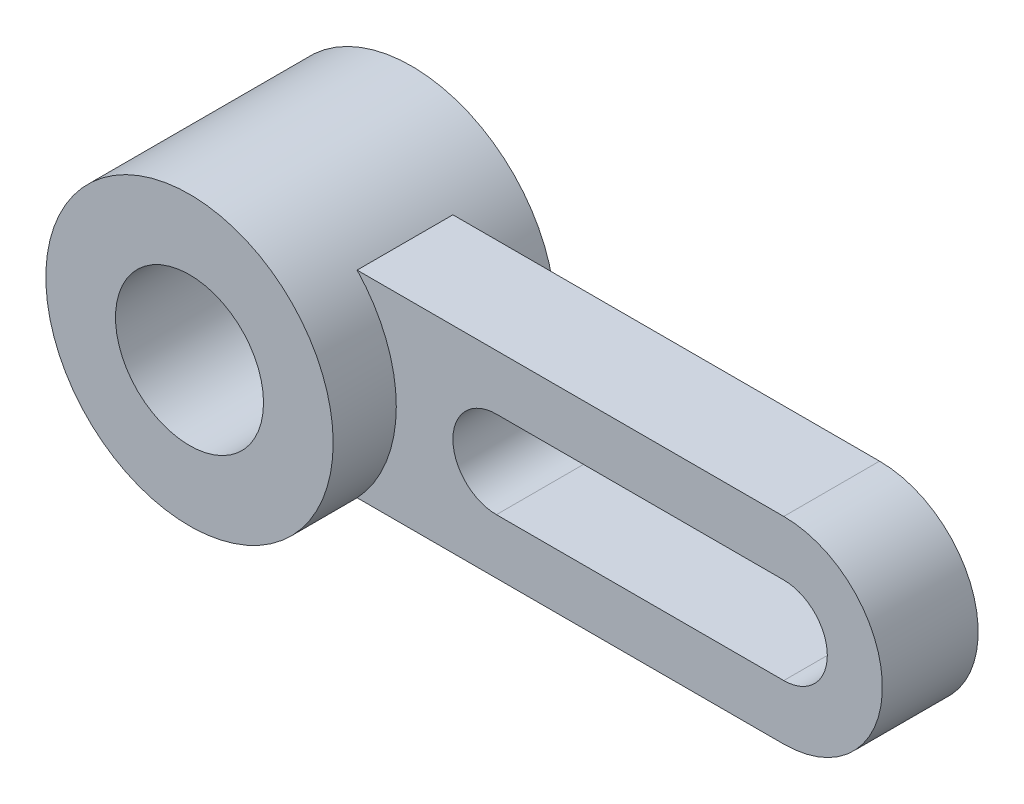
from build123d import *

# Parameters (mm, degrees)
EXTRUDE_1_DEPTH      = 51
EXTRUDE_1_DEPTH_BACK = 51
SKETCH_1_R           = 66
SKETCH_1_R_2         = 34
EXTRUDE_2_DEPTH      = 22
EXTRUDE_2_DEPTH_BACK = 22


with BuildPart() as part:
    # Sketch 1 → Extrude 1 (new, two sides: drawn at the far end of the back side and taken through both)
    with BuildSketch(Plane.XY.offset(-EXTRUDE_1_DEPTH_BACK)):
        Circle(SKETCH_1_R)
        Circle(SKETCH_1_R_2, mode=Mode.SUBTRACT)
    extrude(amount=EXTRUDE_1_DEPTH + EXTRUDE_1_DEPTH_BACK)

    # Sketch 3 → Extrude 2 (add, two sides: drawn at the far end of the back side and taken through both)
    with BuildSketch(Plane.XY.offset(-EXTRUDE_2_DEPTH_BACK)):
        with BuildLine():
            Line((48, 45.299006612), (244, 45.299006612))
            ThreePointArc((244, 45.299006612), (289.299006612, 0), (244, -45.299006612))
            Line((244, -45.299006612), (48, -45.299006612))
            Line((48, -45.299006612), (48, 45.299006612))
        make_face()
        with BuildLine():
            Line((112, 20), (244, 20))
            ThreePointArc((244, 20), (264, 0), (244, -20))
            Line((244, -20), (112, -20))
            ThreePointArc((112, -20), (92, 0), (112, 20))
        make_face(mode=Mode.SUBTRACT)
    extrude(amount=EXTRUDE_2_DEPTH + EXTRUDE_2_DEPTH_BACK)


solid = part.part
